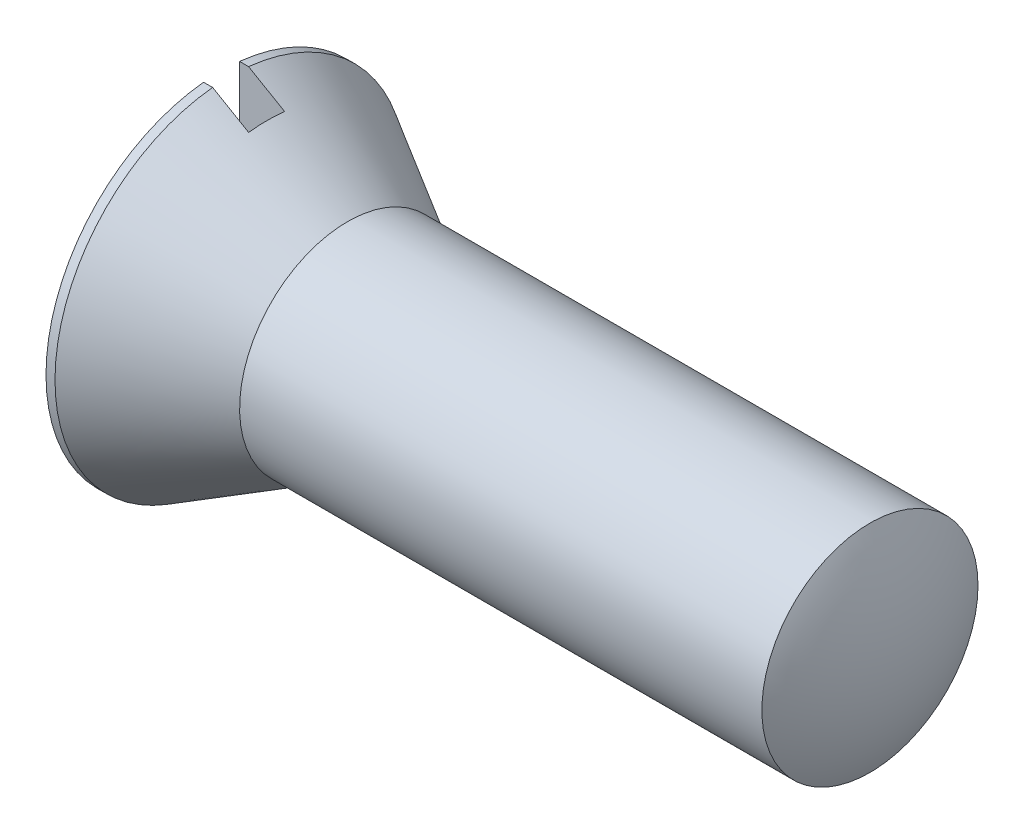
from build123d import *

# Parameters (mm, degrees)
CUTENDSKE_R          = 12
CUTEND_DEPTH         = 3
ROUNDEND_FACE_RADIUS = 12
ROUNDEND_HEIGHT      = 3
CUTSLOTSKE_W         = 5
CUTSLOTSKE_H         = 4
CUTSLOT_DEPTH        = 20.5


with BuildPart() as part:
    # BaseBodySke → BaseBody (revolve)
    with BuildSketch(Plane.XY, mode=Mode.PRIVATE) as basebody_sk:
        Polygon((0, 0), (0, 19.5), (1, 19.5), (14, 12), (75, 12), (75, 0), align=None)
    revolve(basebody_sk.sketch.rotate(Axis((75, 0, 0), (-1, 0, 0)), 90), axis=Axis((75, 0, 0), (-1, 0, 0)))

    # CutEndSke → CutEnd (cut)
    with BuildSketch(Plane(origin=(75, 0, 0), x_dir=(0, 0, -1), z_dir=(1, 0, 0))):
        Circle(CUTENDSKE_R)
    extrude(amount=-CUTEND_DEPTH, mode=Mode.SUBTRACT)

    # RoundEnd: a dome of height H over a round flat face of radius A is a cap of a sphere of radius (A * A + H * H) / (2 * H)
    roundend_r = (ROUNDEND_FACE_RADIUS * ROUNDEND_FACE_RADIUS + ROUNDEND_HEIGHT * ROUNDEND_HEIGHT) / (2 * ROUNDEND_HEIGHT)
    roundend_base = Plane((72, 0, 0), z_dir=(1, 0, 0))
    with Locations(roundend_base.offset(ROUNDEND_HEIGHT - roundend_r)):
        roundend_ball = Sphere(roundend_r, mode=Mode.PRIVATE)
    add(split(roundend_ball, bisect_by=roundend_base, keep=Keep.TOP, mode=Mode.PRIVATE))

    # CutSlotSke → CutSlot (cut, symmetric)
    with BuildSketch(Plane(origin=(0, 0, 0), x_dir=(1, 0, 0), z_dir=(0, 1, 0))):
        with Locations((2.5, 0)):
            Rectangle(CUTSLOTSKE_W, CUTSLOTSKE_H)
    extrude(amount=CUTSLOT_DEPTH, both=True, mode=Mode.SUBTRACT)


solid = part.part
